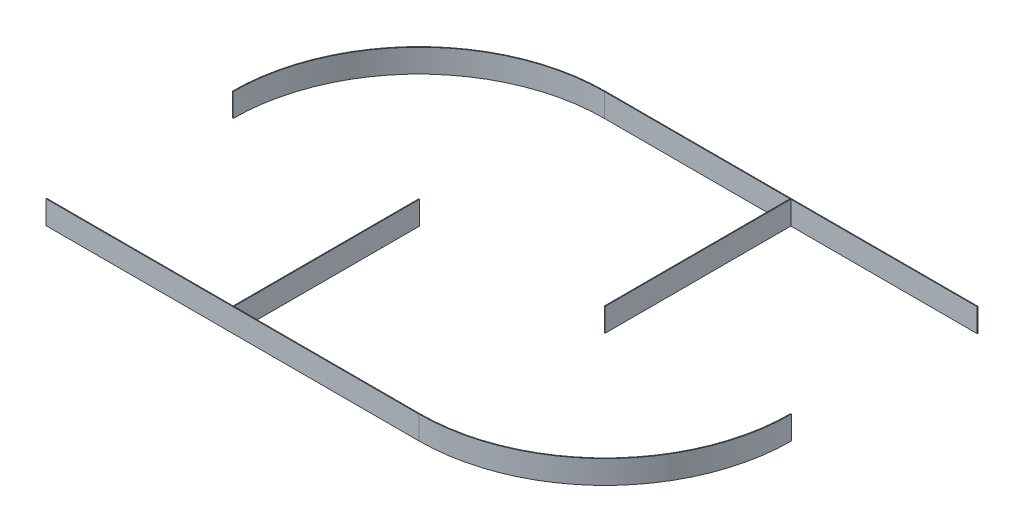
ISO-10303-21;
HEADER;
FILE_DESCRIPTION(('STEP AP214'),'2;1');
FILE_NAME('part.step','',(''),(''),'','','');
FILE_SCHEMA(('AUTOMOTIVE_DESIGN { 1 0 10303 214 1 1 1 1 }'));
ENDSEC;
DATA;
#1=APPLICATION_CONTEXT('core data for automotive mechanical design processes');
#2=APPLICATION_PROTOCOL_DEFINITION('international standard','automotive_design',2000,#1);
#3=PRODUCT_CONTEXT('',#1,'mechanical');
#4=PRODUCT('Part','Part','',(#3));
#5=PRODUCT_RELATED_PRODUCT_CATEGORY('part','',(#4));
#6=PRODUCT_DEFINITION_FORMATION('','',#4);
#7=PRODUCT_DEFINITION_CONTEXT('part definition',#1,'design');
#8=PRODUCT_DEFINITION('design','',#6,#7);
#9=PRODUCT_DEFINITION_SHAPE('','',#8);
#10=(LENGTH_UNIT() NAMED_UNIT(*) SI_UNIT(.MILLI.,.METRE.));
#11=(NAMED_UNIT(*) PLANE_ANGLE_UNIT() SI_UNIT($,.RADIAN.));
#12=(NAMED_UNIT(*) SI_UNIT($,.STERADIAN.) SOLID_ANGLE_UNIT());
#13=UNCERTAINTY_MEASURE_WITH_UNIT(LENGTH_MEASURE(1.E-05),#10,'distance_accuracy_value','');
#14=(GEOMETRIC_REPRESENTATION_CONTEXT(3) GLOBAL_UNCERTAINTY_ASSIGNED_CONTEXT((#13)) GLOBAL_UNIT_ASSIGNED_CONTEXT((#10,
#11,#12)) REPRESENTATION_CONTEXT('',''));
#15=CARTESIAN_POINT('',(0.,0.,0.));
#16=DIRECTION('',(0.,0.,1.));
#17=DIRECTION('',(1.,0.,0.));
#18=AXIS2_PLACEMENT_3D('',#15,#16,#17);
#19=CARTESIAN_POINT('',(-304.8,76.2,-607.06));
#20=DIRECTION('',(0.,0.,-1.));
#21=DIRECTION('',(-1.,0.,0.));
#22=AXIS2_PLACEMENT_3D('',#19,#20,#21);
#23=PLANE('',#22);
#24=DIRECTION('',(1.,0.,0.));
#25=VECTOR('',#24,1.);
#26=CARTESIAN_POINT('',(-304.8,0.,-607.06));
#27=LINE('',#26,#25);
#28=CARTESIAN_POINT('',(-304.8,0.,-607.06));
#29=VERTEX_POINT('',#28);
#30=CARTESIAN_POINT('',(914.4,0.,-607.06));
#31=VERTEX_POINT('',#30);
#32=EDGE_CURVE('E220',#29,#31,#27,.T.);
#33=ORIENTED_EDGE('',*,*,#32,.T.);
#34=DIRECTION('',(0.,-1.,0.));
#35=VECTOR('',#34,1.);
#36=CARTESIAN_POINT('',(914.4,76.2,-607.06));
#37=LINE('',#36,#35);
#38=CARTESIAN_POINT('',(914.4,76.2,-607.06));
#39=VERTEX_POINT('',#38);
#40=EDGE_CURVE('E13',#39,#31,#37,.T.);
#41=ORIENTED_EDGE('',*,*,#40,.F.);
#42=DIRECTION('',(1.,0.,0.));
#43=VECTOR('',#42,1.);
#44=CARTESIAN_POINT('',(-304.8,76.2,-607.06));
#45=LINE('',#44,#43);
#46=CARTESIAN_POINT('',(-304.8,76.2,-607.06));
#47=VERTEX_POINT('',#46);
#48=EDGE_CURVE('E185',#47,#39,#45,.T.);
#49=ORIENTED_EDGE('',*,*,#48,.F.);
#50=DIRECTION('',(0.,-1.,0.));
#51=VECTOR('',#50,1.);
#52=CARTESIAN_POINT('',(-304.8,76.2,-607.06));
#53=LINE('',#52,#51);
#54=EDGE_CURVE('E216',#47,#29,#53,.T.);
#55=ORIENTED_EDGE('',*,*,#54,.T.);
#56=EDGE_LOOP('',(#33,#41,#49,#55));
#57=FACE_BOUND('',#56,.T.);
#58=ADVANCED_FACE('F139',(#57),#23,.F.);
#59=CARTESIAN_POINT('',(914.4,76.2,-609.6));
#60=DIRECTION('',(1.,0.,0.));
#61=DIRECTION('',(0.,0.,-1.));
#62=AXIS2_PLACEMENT_3D('',#59,#60,#61);
#63=PLANE('',#62);
#64=DIRECTION('',(0.,0.,1.));
#65=VECTOR('',#64,1.);
#66=CARTESIAN_POINT('',(914.4,0.,-609.6));
#67=LINE('',#66,#65);
#68=CARTESIAN_POINT('',(914.4,0.,-609.6));
#69=VERTEX_POINT('',#68);
#70=EDGE_CURVE('E223',#69,#31,#67,.T.);
#71=ORIENTED_EDGE('',*,*,#70,.F.);
#72=DIRECTION('',(0.,-1.,0.));
#73=VECTOR('',#72,1.);
#74=CARTESIAN_POINT('',(914.4,76.2,-609.6));
#75=LINE('',#74,#73);
#76=CARTESIAN_POINT('',(914.4,76.2,-609.6));
#77=VERTEX_POINT('',#76);
#78=EDGE_CURVE('E147',#77,#69,#75,.T.);
#79=ORIENTED_EDGE('',*,*,#78,.F.);
#80=DIRECTION('',(0.,0.,1.));
#81=VECTOR('',#80,1.);
#82=CARTESIAN_POINT('',(914.4,76.2,-609.6));
#83=LINE('',#82,#81);
#84=EDGE_CURVE('E309',#77,#39,#83,.T.);
#85=ORIENTED_EDGE('',*,*,#84,.T.);
#86=ORIENTED_EDGE('',*,*,#40,.T.);
#87=EDGE_LOOP('',(#71,#79,#85,#86));
#88=FACE_BOUND('',#87,.T.);
#89=ADVANCED_FACE('F241',(#88),#63,.T.);
#90=CARTESIAN_POINT('',(-304.8,76.2,-609.6));
#91=DIRECTION('',(0.,0.,-1.));
#92=DIRECTION('',(-1.,0.,0.));
#93=AXIS2_PLACEMENT_3D('',#90,#91,#92);
#94=PLANE('',#93);
#95=DIRECTION('',(1.,0.,0.));
#96=VECTOR('',#95,1.);
#97=CARTESIAN_POINT('',(-304.8,0.,-609.6));
#98=LINE('',#97,#96);
#99=CARTESIAN_POINT('',(-304.8,0.,-609.6));
#100=VERTEX_POINT('',#99);
#101=EDGE_CURVE('E226',#100,#69,#98,.T.);
#102=ORIENTED_EDGE('',*,*,#101,.F.);
#103=DIRECTION('',(0.,-1.,0.));
#104=VECTOR('',#103,1.);
#105=CARTESIAN_POINT('',(-304.8,76.2,-609.6));
#106=LINE('',#105,#104);
#107=CARTESIAN_POINT('',(-304.8,76.2,-609.6));
#108=VERTEX_POINT('',#107);
#109=EDGE_CURVE('E206',#108,#100,#106,.T.);
#110=ORIENTED_EDGE('',*,*,#109,.F.);
#111=DIRECTION('',(1.,0.,0.));
#112=VECTOR('',#111,1.);
#113=CARTESIAN_POINT('',(-304.8,76.2,-609.6));
#114=LINE('',#113,#112);
#115=EDGE_CURVE('E212',#108,#77,#114,.T.);
#116=ORIENTED_EDGE('',*,*,#115,.T.);
#117=ORIENTED_EDGE('',*,*,#78,.T.);
#118=EDGE_LOOP('',(#102,#110,#116,#117));
#119=FACE_BOUND('',#118,.T.);
#120=ADVANCED_FACE('F238',(#119),#94,.T.);
#121=CARTESIAN_POINT('',(-304.8,76.2,0.));
#122=DIRECTION('',(0.,-1.,0.));
#123=DIRECTION('',(0.,0.,-1.));
#124=AXIS2_PLACEMENT_3D('',#121,#122,#123);
#125=CYLINDRICAL_SURFACE('',#124,609.6);
#126=CARTESIAN_POINT('',(-304.8,0.,0.));
#127=DIRECTION('',(0.,-1.,0.));
#128=DIRECTION('',(0.,0.,1.));
#129=AXIS2_PLACEMENT_3D('',#126,#127,#128);
#130=CIRCLE('',#129,609.6);
#131=CARTESIAN_POINT('',(-914.4,0.,-1.11981703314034E-13));
#132=VERTEX_POINT('',#131);
#133=EDGE_CURVE('E201',#132,#100,#130,.T.);
#134=ORIENTED_EDGE('',*,*,#133,.F.);
#135=DIRECTION('',(0.,-1.,0.));
#136=VECTOR('',#135,1.);
#137=CARTESIAN_POINT('',(-914.4,76.2,-1.11981703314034E-13));
#138=LINE('',#137,#136);
#139=CARTESIAN_POINT('',(-914.4,76.2,-1.11981703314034E-13));
#140=VERTEX_POINT('',#139);
#141=EDGE_CURVE('E196',#140,#132,#138,.T.);
#142=ORIENTED_EDGE('',*,*,#141,.F.);
#143=CARTESIAN_POINT('',(-304.8,76.2,0.));
#144=DIRECTION('',(0.,-1.,0.));
#145=DIRECTION('',(0.,0.,1.));
#146=AXIS2_PLACEMENT_3D('',#143,#144,#145);
#147=CIRCLE('',#146,609.6);
#148=EDGE_CURVE('E199',#140,#108,#147,.T.);
#149=ORIENTED_EDGE('',*,*,#148,.T.);
#150=ORIENTED_EDGE('',*,*,#109,.T.);
#151=EDGE_LOOP('',(#134,#142,#149,#150));
#152=FACE_BOUND('',#151,.T.);
#153=ADVANCED_FACE('F198',(#152),#125,.T.);
#154=CARTESIAN_POINT('',(-911.86,76.2,0.));
#155=DIRECTION('',(0.,0.,1.));
#156=DIRECTION('',(1.,0.,0.));
#157=AXIS2_PLACEMENT_3D('',#154,#155,#156);
#158=PLANE('',#157);
#159=DIRECTION('',(-1.,0.,0.));
#160=VECTOR('',#159,1.);
#161=CARTESIAN_POINT('',(-911.86,0.,0.));
#162=LINE('',#161,#160);
#163=CARTESIAN_POINT('',(-911.86,0.,0.));
#164=VERTEX_POINT('',#163);
#165=EDGE_CURVE('E230',#164,#132,#162,.T.);
#166=ORIENTED_EDGE('',*,*,#165,.F.);
#167=DIRECTION('',(0.,-1.,0.));
#168=VECTOR('',#167,1.);
#169=CARTESIAN_POINT('',(-911.86,76.2,0.));
#170=LINE('',#169,#168);
#171=CARTESIAN_POINT('',(-911.86,76.2,0.));
#172=VERTEX_POINT('',#171);
#173=EDGE_CURVE('E176',#172,#164,#170,.T.);
#174=ORIENTED_EDGE('',*,*,#173,.F.);
#175=DIRECTION('',(-1.,0.,0.));
#176=VECTOR('',#175,1.);
#177=CARTESIAN_POINT('',(-911.86,76.2,0.));
#178=LINE('',#177,#176);
#179=EDGE_CURVE('E210',#172,#140,#178,.T.);
#180=ORIENTED_EDGE('',*,*,#179,.T.);
#181=ORIENTED_EDGE('',*,*,#141,.T.);
#182=EDGE_LOOP('',(#166,#174,#180,#181));
#183=FACE_BOUND('',#182,.T.);
#184=ADVANCED_FACE('F214',(#183),#158,.T.);
#185=CARTESIAN_POINT('',(-304.8,76.2,0.));
#186=DIRECTION('',(0.,-1.,0.));
#187=DIRECTION('',(0.,0.,-1.));
#188=AXIS2_PLACEMENT_3D('',#185,#186,#187);
#189=CYLINDRICAL_SURFACE('',#188,607.06);
#190=CARTESIAN_POINT('',(-304.8,0.,0.));
#191=DIRECTION('',(0.,1.,0.));
#192=DIRECTION('',(1.,0.,0.));
#193=AXIS2_PLACEMENT_3D('',#190,#191,#192);
#194=CIRCLE('',#193,607.06);
#195=EDGE_CURVE('E179',#164,#29,#194,.F.);
#196=ORIENTED_EDGE('',*,*,#195,.T.);
#197=ORIENTED_EDGE('',*,*,#54,.F.);
#198=CARTESIAN_POINT('',(-304.8,76.2,0.));
#199=DIRECTION('',(0.,1.,0.));
#200=DIRECTION('',(1.,0.,0.));
#201=AXIS2_PLACEMENT_3D('',#198,#199,#200);
#202=CIRCLE('',#201,607.06);
#203=EDGE_CURVE('E155',#172,#47,#202,.F.);
#204=ORIENTED_EDGE('',*,*,#203,.F.);
#205=ORIENTED_EDGE('',*,*,#173,.T.);
#206=EDGE_LOOP('',(#196,#197,#204,#205));
#207=FACE_BOUND('',#206,.T.);
#208=ADVANCED_FACE('F246',(#207),#189,.F.);
#209=CARTESIAN_POINT('',(-304.8,76.2,0.));
#210=DIRECTION('',(0.,-1.,0.));
#211=DIRECTION('',(-1.,0.,0.));
#212=AXIS2_PLACEMENT_3D('',#209,#210,#211);
#213=PLANE('',#212);
#214=ORIENTED_EDGE('',*,*,#48,.T.);
#215=ORIENTED_EDGE('',*,*,#84,.F.);
#216=ORIENTED_EDGE('',*,*,#115,.F.);
#217=ORIENTED_EDGE('',*,*,#148,.F.);
#218=ORIENTED_EDGE('',*,*,#179,.F.);
#219=ORIENTED_EDGE('',*,*,#203,.T.);
#220=EDGE_LOOP('',(#214,#215,#216,#217,#218,#219));
#221=FACE_BOUND('',#220,.T.);
#222=ADVANCED_FACE('F209',(#221),#213,.F.);
#223=CARTESIAN_POINT('',(-304.8,0.,0.));
#224=DIRECTION('',(0.,-1.,0.));
#225=DIRECTION('',(-1.,0.,0.));
#226=AXIS2_PLACEMENT_3D('',#223,#224,#225);
#227=PLANE('',#226);
#228=ORIENTED_EDGE('',*,*,#32,.F.);
#229=ORIENTED_EDGE('',*,*,#195,.F.);
#230=ORIENTED_EDGE('',*,*,#165,.T.);
#231=ORIENTED_EDGE('',*,*,#133,.T.);
#232=ORIENTED_EDGE('',*,*,#101,.T.);
#233=ORIENTED_EDGE('',*,*,#70,.T.);
#234=EDGE_LOOP('',(#228,#229,#230,#231,#232,#233));
#235=FACE_BOUND('',#234,.T.);
#236=ADVANCED_FACE('F244',(#235),#227,.T.);
#237=CLOSED_SHELL('',(#58,#89,#120,#153,#184,#208,#222,#236));
#238=MANIFOLD_SOLID_BREP('B2',#237);
#239=CARTESIAN_POINT('',(302.26,76.2,-609.6));
#240=DIRECTION('',(1.,0.,0.));
#241=DIRECTION('',(0.,0.,-1.));
#242=AXIS2_PLACEMENT_3D('',#239,#240,#241);
#243=PLANE('',#242);
#244=DIRECTION('',(0.,0.,1.));
#245=VECTOR('',#244,1.);
#246=CARTESIAN_POINT('',(302.26,0.,-609.6));
#247=LINE('',#246,#245);
#248=CARTESIAN_POINT('',(302.26,0.,-609.6));
#249=VERTEX_POINT('',#248);
#250=CARTESIAN_POINT('',(302.26,0.,-1.11022302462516E-13));
#251=VERTEX_POINT('',#250);
#252=EDGE_CURVE('E387',#249,#251,#247,.T.);
#253=ORIENTED_EDGE('',*,*,#252,.T.);
#254=DIRECTION('',(0.,-1.,0.));
#255=VECTOR('',#254,1.);
#256=CARTESIAN_POINT('',(302.26,76.2,-1.11022302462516E-13));
#257=LINE('',#256,#255);
#258=CARTESIAN_POINT('',(302.26,76.2,-1.11022302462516E-13));
#259=VERTEX_POINT('',#258);
#260=EDGE_CURVE('E137',#259,#251,#257,.T.);
#261=ORIENTED_EDGE('',*,*,#260,.F.);
#262=DIRECTION('',(0.,0.,1.));
#263=VECTOR('',#262,1.);
#264=CARTESIAN_POINT('',(302.26,76.2,-609.6));
#265=LINE('',#264,#263);
#266=CARTESIAN_POINT('',(302.26,76.2,-609.6));
#267=VERTEX_POINT('',#266);
#268=EDGE_CURVE('E364',#267,#259,#265,.T.);
#269=ORIENTED_EDGE('',*,*,#268,.F.);
#270=DIRECTION('',(0.,-1.,0.));
#271=VECTOR('',#270,1.);
#272=CARTESIAN_POINT('',(302.26,76.2,-609.6));
#273=LINE('',#272,#271);
#274=EDGE_CURVE('E340',#267,#249,#273,.T.);
#275=ORIENTED_EDGE('',*,*,#274,.T.);
#276=EDGE_LOOP('',(#253,#261,#269,#275));
#277=FACE_BOUND('',#276,.T.);
#278=ADVANCED_FACE('F324',(#277),#243,.F.);
#279=CARTESIAN_POINT('',(304.8,76.2,-1.11022302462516E-13));
#280=DIRECTION('',(0.,0.,1.));
#281=DIRECTION('',(1.,0.,0.));
#282=AXIS2_PLACEMENT_3D('',#279,#280,#281);
#283=PLANE('',#282);
#284=DIRECTION('',(-1.,0.,0.));
#285=VECTOR('',#284,1.);
#286=CARTESIAN_POINT('',(304.8,0.,-1.11022302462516E-13));
#287=LINE('',#286,#285);
#288=CARTESIAN_POINT('',(304.8,0.,-1.11022302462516E-13));
#289=VERTEX_POINT('',#288);
#290=EDGE_CURVE('E373',#289,#251,#287,.T.);
#291=ORIENTED_EDGE('',*,*,#290,.F.);
#292=DIRECTION('',(0.,-1.,0.));
#293=VECTOR('',#292,1.);
#294=CARTESIAN_POINT('',(304.8,76.2,-1.11022302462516E-13));
#295=LINE('',#294,#293);
#296=CARTESIAN_POINT('',(304.8,76.2,-1.11022302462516E-13));
#297=VERTEX_POINT('',#296);
#298=EDGE_CURVE('E332',#297,#289,#295,.T.);
#299=ORIENTED_EDGE('',*,*,#298,.F.);
#300=DIRECTION('',(-1.,0.,0.));
#301=VECTOR('',#300,1.);
#302=CARTESIAN_POINT('',(304.8,76.2,-1.11022302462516E-13));
#303=LINE('',#302,#301);
#304=EDGE_CURVE('E371',#297,#259,#303,.T.);
#305=ORIENTED_EDGE('',*,*,#304,.T.);
#306=ORIENTED_EDGE('',*,*,#260,.T.);
#307=EDGE_LOOP('',(#291,#299,#305,#306));
#308=FACE_BOUND('',#307,.T.);
#309=ADVANCED_FACE('F370',(#308),#283,.T.);
#310=CARTESIAN_POINT('',(304.8,76.2,-609.6));
#311=DIRECTION('',(1.,0.,0.));
#312=DIRECTION('',(0.,0.,-1.));
#313=AXIS2_PLACEMENT_3D('',#310,#311,#312);
#314=PLANE('',#313);
#315=DIRECTION('',(0.,0.,1.));
#316=VECTOR('',#315,1.);
#317=CARTESIAN_POINT('',(304.8,0.,-609.6));
#318=LINE('',#317,#316);
#319=CARTESIAN_POINT('',(304.8,0.,-609.6));
#320=VERTEX_POINT('',#319);
#321=EDGE_CURVE('E390',#320,#289,#318,.T.);
#322=ORIENTED_EDGE('',*,*,#321,.F.);
#323=DIRECTION('',(0.,-1.,0.));
#324=VECTOR('',#323,1.);
#325=CARTESIAN_POINT('',(304.8,76.2,-609.6));
#326=LINE('',#325,#324);
#327=CARTESIAN_POINT('',(304.8,76.2,-609.6));
#328=VERTEX_POINT('',#327);
#329=EDGE_CURVE('E353',#328,#320,#326,.T.);
#330=ORIENTED_EDGE('',*,*,#329,.F.);
#331=DIRECTION('',(0.,0.,1.));
#332=VECTOR('',#331,1.);
#333=CARTESIAN_POINT('',(304.8,76.2,-609.6));
#334=LINE('',#333,#332);
#335=EDGE_CURVE('E379',#328,#297,#334,.T.);
#336=ORIENTED_EDGE('',*,*,#335,.T.);
#337=ORIENTED_EDGE('',*,*,#298,.T.);
#338=EDGE_LOOP('',(#322,#330,#336,#337));
#339=FACE_BOUND('',#338,.T.);
#340=ADVANCED_FACE('F381',(#339),#314,.T.);
#341=CARTESIAN_POINT('',(302.26,76.2,-609.6));
#342=DIRECTION('',(0.,0.,-1.));
#343=DIRECTION('',(-1.,0.,0.));
#344=AXIS2_PLACEMENT_3D('',#341,#342,#343);
#345=PLANE('',#344);
#346=DIRECTION('',(1.,0.,0.));
#347=VECTOR('',#346,1.);
#348=CARTESIAN_POINT('',(302.26,0.,-609.6));
#349=LINE('',#348,#347);
#350=EDGE_CURVE('E392',#249,#320,#349,.T.);
#351=ORIENTED_EDGE('',*,*,#350,.F.);
#352=ORIENTED_EDGE('',*,*,#274,.F.);
#353=DIRECTION('',(1.,0.,0.));
#354=VECTOR('',#353,1.);
#355=CARTESIAN_POINT('',(302.26,76.2,-609.6));
#356=LINE('',#355,#354);
#357=EDGE_CURVE('E382',#267,#328,#356,.T.);
#358=ORIENTED_EDGE('',*,*,#357,.T.);
#359=ORIENTED_EDGE('',*,*,#329,.T.);
#360=EDGE_LOOP('',(#351,#352,#358,#359));
#361=FACE_BOUND('',#360,.T.);
#362=ADVANCED_FACE('F398',(#361),#345,.T.);
#363=CARTESIAN_POINT('',(0.,76.2,0.));
#364=DIRECTION('',(0.,-1.,0.));
#365=DIRECTION('',(-1.,0.,0.));
#366=AXIS2_PLACEMENT_3D('',#363,#364,#365);
#367=PLANE('',#366);
#368=ORIENTED_EDGE('',*,*,#268,.T.);
#369=ORIENTED_EDGE('',*,*,#304,.F.);
#370=ORIENTED_EDGE('',*,*,#335,.F.);
#371=ORIENTED_EDGE('',*,*,#357,.F.);
#372=EDGE_LOOP('',(#368,#369,#370,#371));
#373=FACE_BOUND('',#372,.T.);
#374=ADVANCED_FACE('F378',(#373),#367,.F.);
#375=CARTESIAN_POINT('',(0.,0.,0.));
#376=DIRECTION('',(0.,-1.,0.));
#377=DIRECTION('',(-1.,0.,0.));
#378=AXIS2_PLACEMENT_3D('',#375,#376,#377);
#379=PLANE('',#378);
#380=ORIENTED_EDGE('',*,*,#252,.F.);
#381=ORIENTED_EDGE('',*,*,#350,.T.);
#382=ORIENTED_EDGE('',*,*,#321,.T.);
#383=ORIENTED_EDGE('',*,*,#290,.T.);
#384=EDGE_LOOP('',(#380,#381,#382,#383));
#385=FACE_BOUND('',#384,.T.);
#386=ADVANCED_FACE('F397',(#385),#379,.T.);
#387=CLOSED_SHELL('',(#278,#309,#340,#362,#374,#386));
#388=MANIFOLD_SOLID_BREP('B7',#387);
#389=CARTESIAN_POINT('',(304.8,76.2,607.06));
#390=DIRECTION('',(0.,0.,1.));
#391=DIRECTION('',(1.,0.,0.));
#392=AXIS2_PLACEMENT_3D('',#389,#390,#391);
#393=PLANE('',#392);
#394=DIRECTION('',(1.,0.,0.));
#395=VECTOR('',#394,1.);
#396=CARTESIAN_POINT('',(304.8,0.,607.06));
#397=LINE('',#396,#395);
#398=CARTESIAN_POINT('',(304.8,0.,607.06));
#399=VERTEX_POINT('',#398);
#400=CARTESIAN_POINT('',(-914.4,0.,607.06));
#401=VERTEX_POINT('',#400);
#402=EDGE_CURVE('E537',#399,#401,#397,.F.);
#403=ORIENTED_EDGE('',*,*,#402,.T.);
#404=DIRECTION('',(0.,-1.,0.));
#405=VECTOR('',#404,1.);
#406=CARTESIAN_POINT('',(-914.4,76.2,607.06));
#407=LINE('',#406,#405);
#408=CARTESIAN_POINT('',(-914.4,76.2,607.06));
#409=VERTEX_POINT('',#408);
#410=EDGE_CURVE('E322',#409,#401,#407,.T.);
#411=ORIENTED_EDGE('',*,*,#410,.F.);
#412=DIRECTION('',(1.,0.,0.));
#413=VECTOR('',#412,1.);
#414=CARTESIAN_POINT('',(304.8,76.2,607.06));
#415=LINE('',#414,#413);
#416=CARTESIAN_POINT('',(304.8,76.2,607.06));
#417=VERTEX_POINT('',#416);
#418=EDGE_CURVE('E502',#417,#409,#415,.F.);
#419=ORIENTED_EDGE('',*,*,#418,.F.);
#420=DIRECTION('',(0.,-1.,0.));
#421=VECTOR('',#420,1.);
#422=CARTESIAN_POINT('',(304.8,76.2,607.06));
#423=LINE('',#422,#421);
#424=EDGE_CURVE('E533',#417,#399,#423,.T.);
#425=ORIENTED_EDGE('',*,*,#424,.T.);
#426=EDGE_LOOP('',(#403,#411,#419,#425));
#427=FACE_BOUND('',#426,.T.);
#428=ADVANCED_FACE('F456',(#427),#393,.F.);
#429=CARTESIAN_POINT('',(-914.4,76.2,609.6));
#430=DIRECTION('',(-1.,0.,0.));
#431=DIRECTION('',(0.,0.,1.));
#432=AXIS2_PLACEMENT_3D('',#429,#430,#431);
#433=PLANE('',#432);
#434=DIRECTION('',(0.,0.,-1.));
#435=VECTOR('',#434,1.);
#436=CARTESIAN_POINT('',(-914.4,0.,609.6));
#437=LINE('',#436,#435);
#438=CARTESIAN_POINT('',(-914.4,0.,609.6));
#439=VERTEX_POINT('',#438);
#440=EDGE_CURVE('E540',#439,#401,#437,.T.);
#441=ORIENTED_EDGE('',*,*,#440,.F.);
#442=DIRECTION('',(0.,-1.,0.));
#443=VECTOR('',#442,1.);
#444=CARTESIAN_POINT('',(-914.4,76.2,609.6));
#445=LINE('',#444,#443);
#446=CARTESIAN_POINT('',(-914.4,76.2,609.6));
#447=VERTEX_POINT('',#446);
#448=EDGE_CURVE('E464',#447,#439,#445,.T.);
#449=ORIENTED_EDGE('',*,*,#448,.F.);
#450=DIRECTION('',(0.,0.,-1.));
#451=VECTOR('',#450,1.);
#452=CARTESIAN_POINT('',(-914.4,76.2,609.6));
#453=LINE('',#452,#451);
#454=EDGE_CURVE('E626',#447,#409,#453,.T.);
#455=ORIENTED_EDGE('',*,*,#454,.T.);
#456=ORIENTED_EDGE('',*,*,#410,.T.);
#457=EDGE_LOOP('',(#441,#449,#455,#456));
#458=FACE_BOUND('',#457,.T.);
#459=ADVANCED_FACE('F558',(#458),#433,.T.);
#460=CARTESIAN_POINT('',(304.8,76.2,609.6));
#461=DIRECTION('',(0.,0.,1.));
#462=DIRECTION('',(1.,0.,0.));
#463=AXIS2_PLACEMENT_3D('',#460,#461,#462);
#464=PLANE('',#463);
#465=DIRECTION('',(-1.,0.,0.));
#466=VECTOR('',#465,1.);
#467=CARTESIAN_POINT('',(304.8,0.,609.6));
#468=LINE('',#467,#466);
#469=CARTESIAN_POINT('',(304.8,0.,609.6));
#470=VERTEX_POINT('',#469);
#471=EDGE_CURVE('E543',#470,#439,#468,.T.);
#472=ORIENTED_EDGE('',*,*,#471,.F.);
#473=DIRECTION('',(0.,-1.,0.));
#474=VECTOR('',#473,1.);
#475=CARTESIAN_POINT('',(304.8,76.2,609.6));
#476=LINE('',#475,#474);
#477=CARTESIAN_POINT('',(304.8,76.2,609.6));
#478=VERTEX_POINT('',#477);
#479=EDGE_CURVE('E523',#478,#470,#476,.T.);
#480=ORIENTED_EDGE('',*,*,#479,.F.);
#481=DIRECTION('',(-1.,0.,0.));
#482=VECTOR('',#481,1.);
#483=CARTESIAN_POINT('',(304.8,76.2,609.6));
#484=LINE('',#483,#482);
#485=EDGE_CURVE('E529',#478,#447,#484,.T.);
#486=ORIENTED_EDGE('',*,*,#485,.T.);
#487=ORIENTED_EDGE('',*,*,#448,.T.);
#488=EDGE_LOOP('',(#472,#480,#486,#487));
#489=FACE_BOUND('',#488,.T.);
#490=ADVANCED_FACE('F555',(#489),#464,.T.);
#491=CARTESIAN_POINT('',(304.8,76.2,-1.11022302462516E-13));
#492=DIRECTION('',(0.,-1.,0.));
#493=DIRECTION('',(0.,0.,-1.));
#494=AXIS2_PLACEMENT_3D('',#491,#492,#493);
#495=CYLINDRICAL_SURFACE('',#494,609.6);
#496=CARTESIAN_POINT('',(304.8,0.,-1.11022302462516E-13));
#497=DIRECTION('',(0.,-1.,0.));
#498=DIRECTION('',(0.,0.,1.));
#499=AXIS2_PLACEMENT_3D('',#496,#497,#498);
#500=CIRCLE('',#499,609.6);
#501=CARTESIAN_POINT('',(914.4,0.,0.));
#502=VERTEX_POINT('',#501);
#503=EDGE_CURVE('E518',#502,#470,#500,.T.);
#504=ORIENTED_EDGE('',*,*,#503,.F.);
#505=DIRECTION('',(0.,-1.,0.));
#506=VECTOR('',#505,1.);
#507=CARTESIAN_POINT('',(914.4,76.2,0.));
#508=LINE('',#507,#506);
#509=CARTESIAN_POINT('',(914.4,76.2,0.));
#510=VERTEX_POINT('',#509);
#511=EDGE_CURVE('E513',#510,#502,#508,.T.);
#512=ORIENTED_EDGE('',*,*,#511,.F.);
#513=CARTESIAN_POINT('',(304.8,76.2,-1.11022302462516E-13));
#514=DIRECTION('',(0.,-1.,0.));
#515=DIRECTION('',(0.,0.,1.));
#516=AXIS2_PLACEMENT_3D('',#513,#514,#515);
#517=CIRCLE('',#516,609.6);
#518=EDGE_CURVE('E516',#510,#478,#517,.T.);
#519=ORIENTED_EDGE('',*,*,#518,.T.);
#520=ORIENTED_EDGE('',*,*,#479,.T.);
#521=EDGE_LOOP('',(#504,#512,#519,#520));
#522=FACE_BOUND('',#521,.T.);
#523=ADVANCED_FACE('F515',(#522),#495,.T.);
#524=CARTESIAN_POINT('',(911.86,76.2,-1.11022302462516E-13));
#525=DIRECTION('',(0.,0.,-1.));
#526=DIRECTION('',(-1.,0.,0.));
#527=AXIS2_PLACEMENT_3D('',#524,#525,#526);
#528=PLANE('',#527);
#529=DIRECTION('',(1.,0.,0.));
#530=VECTOR('',#529,1.);
#531=CARTESIAN_POINT('',(911.86,0.,-1.11022302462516E-13));
#532=LINE('',#531,#530);
#533=CARTESIAN_POINT('',(911.86,0.,-1.11022302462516E-13));
#534=VERTEX_POINT('',#533);
#535=EDGE_CURVE('E547',#534,#502,#532,.T.);
#536=ORIENTED_EDGE('',*,*,#535,.F.);
#537=DIRECTION('',(0.,-1.,0.));
#538=VECTOR('',#537,1.);
#539=CARTESIAN_POINT('',(911.86,76.2,-1.11022302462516E-13));
#540=LINE('',#539,#538);
#541=CARTESIAN_POINT('',(911.86,76.2,-1.11022302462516E-13));
#542=VERTEX_POINT('',#541);
#543=EDGE_CURVE('E493',#542,#534,#540,.T.);
#544=ORIENTED_EDGE('',*,*,#543,.F.);
#545=DIRECTION('',(1.,0.,0.));
#546=VECTOR('',#545,1.);
#547=CARTESIAN_POINT('',(911.86,76.2,-1.11022302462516E-13));
#548=LINE('',#547,#546);
#549=EDGE_CURVE('E527',#542,#510,#548,.T.);
#550=ORIENTED_EDGE('',*,*,#549,.T.);
#551=ORIENTED_EDGE('',*,*,#511,.T.);
#552=EDGE_LOOP('',(#536,#544,#550,#551));
#553=FACE_BOUND('',#552,.T.);
#554=ADVANCED_FACE('F531',(#553),#528,.T.);
#555=CARTESIAN_POINT('',(304.8,76.2,-1.11022302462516E-13));
#556=DIRECTION('',(0.,-1.,0.));
#557=DIRECTION('',(0.,0.,-1.));
#558=AXIS2_PLACEMENT_3D('',#555,#556,#557);
#559=CYLINDRICAL_SURFACE('',#558,607.06);
#560=CARTESIAN_POINT('',(304.8,0.,-1.11022302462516E-13));
#561=DIRECTION('',(0.,1.,0.));
#562=DIRECTION('',(1.,0.,0.));
#563=AXIS2_PLACEMENT_3D('',#560,#561,#562);
#564=CIRCLE('',#563,607.06);
#565=EDGE_CURVE('E496',#534,#399,#564,.F.);
#566=ORIENTED_EDGE('',*,*,#565,.T.);
#567=ORIENTED_EDGE('',*,*,#424,.F.);
#568=CARTESIAN_POINT('',(304.8,76.2,-1.11022302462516E-13));
#569=DIRECTION('',(0.,1.,0.));
#570=DIRECTION('',(1.,0.,0.));
#571=AXIS2_PLACEMENT_3D('',#568,#569,#570);
#572=CIRCLE('',#571,607.06);
#573=EDGE_CURVE('E472',#542,#417,#572,.F.);
#574=ORIENTED_EDGE('',*,*,#573,.F.);
#575=ORIENTED_EDGE('',*,*,#543,.T.);
#576=EDGE_LOOP('',(#566,#567,#574,#575));
#577=FACE_BOUND('',#576,.T.);
#578=ADVANCED_FACE('F563',(#577),#559,.F.);
#579=CARTESIAN_POINT('',(304.8,76.2,-1.11022302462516E-13));
#580=DIRECTION('',(0.,-1.,0.));
#581=DIRECTION('',(-1.,0.,0.));
#582=AXIS2_PLACEMENT_3D('',#579,#580,#581);
#583=PLANE('',#582);
#584=ORIENTED_EDGE('',*,*,#418,.T.);
#585=ORIENTED_EDGE('',*,*,#454,.F.);
#586=ORIENTED_EDGE('',*,*,#485,.F.);
#587=ORIENTED_EDGE('',*,*,#518,.F.);
#588=ORIENTED_EDGE('',*,*,#549,.F.);
#589=ORIENTED_EDGE('',*,*,#573,.T.);
#590=EDGE_LOOP('',(#584,#585,#586,#587,#588,#589));
#591=FACE_BOUND('',#590,.T.);
#592=ADVANCED_FACE('F526',(#591),#583,.F.);
#593=CARTESIAN_POINT('',(304.8,0.,-1.11022302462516E-13));
#594=DIRECTION('',(0.,-1.,0.));
#595=DIRECTION('',(-1.,0.,0.));
#596=AXIS2_PLACEMENT_3D('',#593,#594,#595);
#597=PLANE('',#596);
#598=ORIENTED_EDGE('',*,*,#402,.F.);
#599=ORIENTED_EDGE('',*,*,#565,.F.);
#600=ORIENTED_EDGE('',*,*,#535,.T.);
#601=ORIENTED_EDGE('',*,*,#503,.T.);
#602=ORIENTED_EDGE('',*,*,#471,.T.);
#603=ORIENTED_EDGE('',*,*,#440,.T.);
#604=EDGE_LOOP('',(#598,#599,#600,#601,#602,#603));
#605=FACE_BOUND('',#604,.T.);
#606=ADVANCED_FACE('F561',(#605),#597,.T.);
#607=CLOSED_SHELL('',(#428,#459,#490,#523,#554,#578,#592,#606));
#608=MANIFOLD_SOLID_BREP('B131',#607);
#609=CARTESIAN_POINT('',(-302.26,76.2,609.6));
#610=DIRECTION('',(-1.,0.,0.));
#611=DIRECTION('',(0.,0.,1.));
#612=AXIS2_PLACEMENT_3D('',#609,#610,#611);
#613=PLANE('',#612);
#614=DIRECTION('',(0.,0.,-1.));
#615=VECTOR('',#614,1.);
#616=CARTESIAN_POINT('',(-302.26,0.,609.6));
#617=LINE('',#616,#615);
#618=CARTESIAN_POINT('',(-302.26,0.,609.6));
#619=VERTEX_POINT('',#618);
#620=CARTESIAN_POINT('',(-302.26,0.,0.));
#621=VERTEX_POINT('',#620);
#622=EDGE_CURVE('E694',#619,#621,#617,.T.);
#623=ORIENTED_EDGE('',*,*,#622,.T.);
#624=DIRECTION('',(0.,-1.,0.));
#625=VECTOR('',#624,1.);
#626=CARTESIAN_POINT('',(-302.26,76.2,0.));
#627=LINE('',#626,#625);
#628=CARTESIAN_POINT('',(-302.26,76.2,0.));
#629=VERTEX_POINT('',#628);
#630=EDGE_CURVE('E454',#629,#621,#627,.T.);
#631=ORIENTED_EDGE('',*,*,#630,.F.);
#632=DIRECTION('',(0.,0.,-1.));
#633=VECTOR('',#632,1.);
#634=CARTESIAN_POINT('',(-302.26,76.2,609.6));
#635=LINE('',#634,#633);
#636=CARTESIAN_POINT('',(-302.26,76.2,609.6));
#637=VERTEX_POINT('',#636);
#638=EDGE_CURVE('E671',#637,#629,#635,.T.);
#639=ORIENTED_EDGE('',*,*,#638,.F.);
#640=DIRECTION('',(0.,-1.,0.));
#641=VECTOR('',#640,1.);
#642=CARTESIAN_POINT('',(-302.26,76.2,609.6));
#643=LINE('',#642,#641);
#644=EDGE_CURVE('E647',#637,#619,#643,.T.);
#645=ORIENTED_EDGE('',*,*,#644,.T.);
#646=EDGE_LOOP('',(#623,#631,#639,#645));
#647=FACE_BOUND('',#646,.T.);
#648=ADVANCED_FACE('F631',(#647),#613,.F.);
#649=CARTESIAN_POINT('',(-304.8,76.2,0.));
#650=DIRECTION('',(0.,0.,-1.));
#651=DIRECTION('',(-1.,0.,0.));
#652=AXIS2_PLACEMENT_3D('',#649,#650,#651);
#653=PLANE('',#652);
#654=DIRECTION('',(1.,0.,0.));
#655=VECTOR('',#654,1.);
#656=CARTESIAN_POINT('',(-304.8,0.,0.));
#657=LINE('',#656,#655);
#658=CARTESIAN_POINT('',(-304.8,0.,0.));
#659=VERTEX_POINT('',#658);
#660=EDGE_CURVE('E680',#659,#621,#657,.T.);
#661=ORIENTED_EDGE('',*,*,#660,.F.);
#662=DIRECTION('',(0.,-1.,0.));
#663=VECTOR('',#662,1.);
#664=CARTESIAN_POINT('',(-304.8,76.2,0.));
#665=LINE('',#664,#663);
#666=CARTESIAN_POINT('',(-304.8,76.2,0.));
#667=VERTEX_POINT('',#666);
#668=EDGE_CURVE('E639',#667,#659,#665,.T.);
#669=ORIENTED_EDGE('',*,*,#668,.F.);
#670=DIRECTION('',(1.,0.,0.));
#671=VECTOR('',#670,1.);
#672=CARTESIAN_POINT('',(-304.8,76.2,0.));
#673=LINE('',#672,#671);
#674=EDGE_CURVE('E678',#667,#629,#673,.T.);
#675=ORIENTED_EDGE('',*,*,#674,.T.);
#676=ORIENTED_EDGE('',*,*,#630,.T.);
#677=EDGE_LOOP('',(#661,#669,#675,#676));
#678=FACE_BOUND('',#677,.T.);
#679=ADVANCED_FACE('F677',(#678),#653,.T.);
#680=CARTESIAN_POINT('',(-304.8,76.2,609.6));
#681=DIRECTION('',(-1.,0.,0.));
#682=DIRECTION('',(0.,0.,1.));
#683=AXIS2_PLACEMENT_3D('',#680,#681,#682);
#684=PLANE('',#683);
#685=DIRECTION('',(0.,0.,-1.));
#686=VECTOR('',#685,1.);
#687=CARTESIAN_POINT('',(-304.8,0.,609.6));
#688=LINE('',#687,#686);
#689=CARTESIAN_POINT('',(-304.8,0.,609.6));
#690=VERTEX_POINT('',#689);
#691=EDGE_CURVE('E697',#690,#659,#688,.T.);
#692=ORIENTED_EDGE('',*,*,#691,.F.);
#693=DIRECTION('',(0.,-1.,0.));
#694=VECTOR('',#693,1.);
#695=CARTESIAN_POINT('',(-304.8,76.2,609.6));
#696=LINE('',#695,#694);
#697=CARTESIAN_POINT('',(-304.8,76.2,609.6));
#698=VERTEX_POINT('',#697);
#699=EDGE_CURVE('E660',#698,#690,#696,.T.);
#700=ORIENTED_EDGE('',*,*,#699,.F.);
#701=DIRECTION('',(0.,0.,-1.));
#702=VECTOR('',#701,1.);
#703=CARTESIAN_POINT('',(-304.8,76.2,609.6));
#704=LINE('',#703,#702);
#705=EDGE_CURVE('E686',#698,#667,#704,.T.);
#706=ORIENTED_EDGE('',*,*,#705,.T.);
#707=ORIENTED_EDGE('',*,*,#668,.T.);
#708=EDGE_LOOP('',(#692,#700,#706,#707));
#709=FACE_BOUND('',#708,.T.);
#710=ADVANCED_FACE('F688',(#709),#684,.T.);
#711=CARTESIAN_POINT('',(-302.26,76.2,609.6));
#712=DIRECTION('',(0.,0.,1.));
#713=DIRECTION('',(1.,0.,0.));
#714=AXIS2_PLACEMENT_3D('',#711,#712,#713);
#715=PLANE('',#714);
#716=DIRECTION('',(-1.,0.,0.));
#717=VECTOR('',#716,1.);
#718=CARTESIAN_POINT('',(-302.26,0.,609.6));
#719=LINE('',#718,#717);
#720=EDGE_CURVE('E699',#619,#690,#719,.T.);
#721=ORIENTED_EDGE('',*,*,#720,.F.);
#722=ORIENTED_EDGE('',*,*,#644,.F.);
#723=DIRECTION('',(-1.,0.,0.));
#724=VECTOR('',#723,1.);
#725=CARTESIAN_POINT('',(-302.26,76.2,609.6));
#726=LINE('',#725,#724);
#727=EDGE_CURVE('E689',#637,#698,#726,.T.);
#728=ORIENTED_EDGE('',*,*,#727,.T.);
#729=ORIENTED_EDGE('',*,*,#699,.T.);
#730=EDGE_LOOP('',(#721,#722,#728,#729));
#731=FACE_BOUND('',#730,.T.);
#732=ADVANCED_FACE('F705',(#731),#715,.T.);
#733=CARTESIAN_POINT('',(0.,76.2,0.));
#734=DIRECTION('',(0.,-1.,0.));
#735=DIRECTION('',(-1.,0.,0.));
#736=AXIS2_PLACEMENT_3D('',#733,#734,#735);
#737=PLANE('',#736);
#738=ORIENTED_EDGE('',*,*,#638,.T.);
#739=ORIENTED_EDGE('',*,*,#674,.F.);
#740=ORIENTED_EDGE('',*,*,#705,.F.);
#741=ORIENTED_EDGE('',*,*,#727,.F.);
#742=EDGE_LOOP('',(#738,#739,#740,#741));
#743=FACE_BOUND('',#742,.T.);
#744=ADVANCED_FACE('F685',(#743),#737,.F.);
#745=CARTESIAN_POINT('',(0.,0.,0.));
#746=DIRECTION('',(0.,-1.,0.));
#747=DIRECTION('',(-1.,0.,0.));
#748=AXIS2_PLACEMENT_3D('',#745,#746,#747);
#749=PLANE('',#748);
#750=ORIENTED_EDGE('',*,*,#622,.F.);
#751=ORIENTED_EDGE('',*,*,#720,.T.);
#752=ORIENTED_EDGE('',*,*,#691,.T.);
#753=ORIENTED_EDGE('',*,*,#660,.T.);
#754=EDGE_LOOP('',(#750,#751,#752,#753));
#755=FACE_BOUND('',#754,.T.);
#756=ADVANCED_FACE('F704',(#755),#749,.T.);
#757=CLOSED_SHELL('',(#648,#679,#710,#732,#744,#756));
#758=MANIFOLD_SOLID_BREP('B316',#757);
#759=ADVANCED_BREP_SHAPE_REPRESENTATION('',(#18,#238,#388,#608,#758),#14);
#760=SHAPE_DEFINITION_REPRESENTATION(#9,#759);
ENDSEC;
END-ISO-10303-21;
